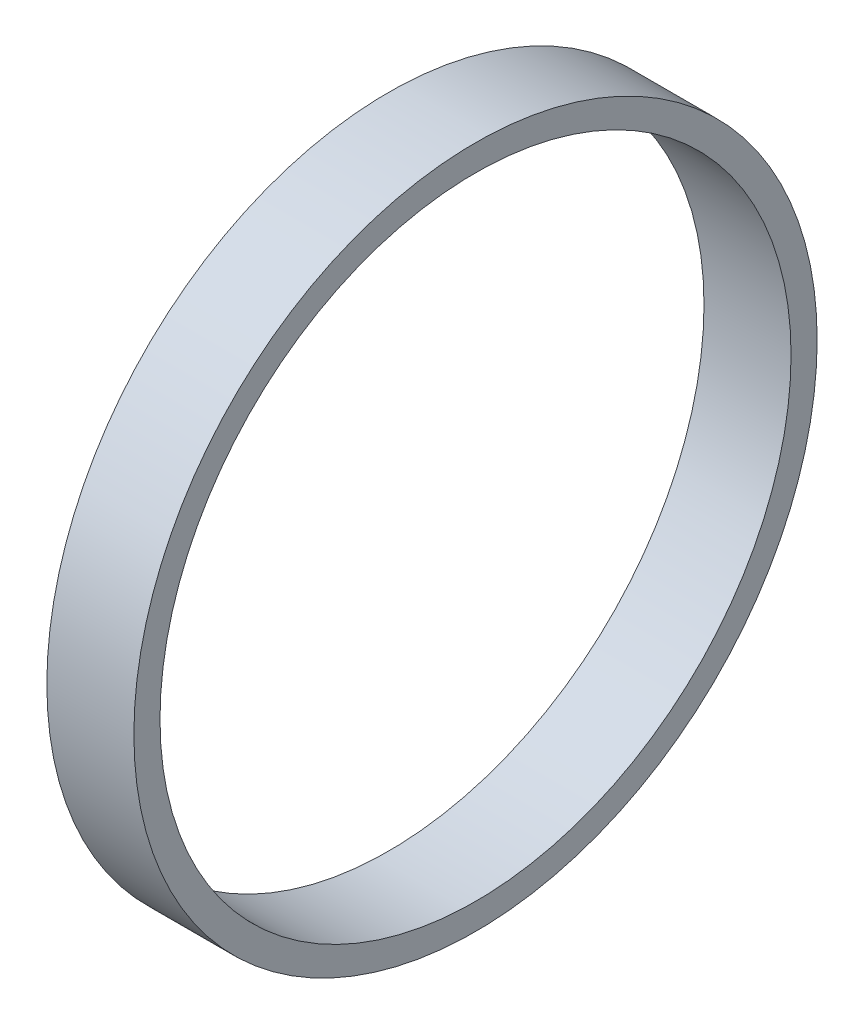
ISO-10303-21;
HEADER;
FILE_DESCRIPTION(('STEP AP214'),'2;1');
FILE_NAME('part.step','',(''),(''),'','','');
FILE_SCHEMA(('AUTOMOTIVE_DESIGN { 1 0 10303 214 1 1 1 1 }'));
ENDSEC;
DATA;
#1=APPLICATION_CONTEXT('core data for automotive mechanical design processes');
#2=APPLICATION_PROTOCOL_DEFINITION('international standard','automotive_design',2000,#1);
#3=PRODUCT_CONTEXT('',#1,'mechanical');
#4=PRODUCT('Part','Part','',(#3));
#5=PRODUCT_RELATED_PRODUCT_CATEGORY('part','',(#4));
#6=PRODUCT_DEFINITION_FORMATION('','',#4);
#7=PRODUCT_DEFINITION_CONTEXT('part definition',#1,'design');
#8=PRODUCT_DEFINITION('design','',#6,#7);
#9=PRODUCT_DEFINITION_SHAPE('','',#8);
#10=(LENGTH_UNIT() NAMED_UNIT(*) SI_UNIT(.MILLI.,.METRE.));
#11=(NAMED_UNIT(*) PLANE_ANGLE_UNIT() SI_UNIT($,.RADIAN.));
#12=(NAMED_UNIT(*) SI_UNIT($,.STERADIAN.) SOLID_ANGLE_UNIT());
#13=UNCERTAINTY_MEASURE_WITH_UNIT(LENGTH_MEASURE(1.E-05),#10,'distance_accuracy_value','');
#14=(GEOMETRIC_REPRESENTATION_CONTEXT(3) GLOBAL_UNCERTAINTY_ASSIGNED_CONTEXT((#13)) GLOBAL_UNIT_ASSIGNED_CONTEXT((#10,
#11,#12)) REPRESENTATION_CONTEXT('',''));
#15=CARTESIAN_POINT('',(0.,0.,0.));
#16=DIRECTION('',(0.,0.,1.));
#17=DIRECTION('',(1.,0.,0.));
#18=AXIS2_PLACEMENT_3D('',#15,#16,#17);
#19=CARTESIAN_POINT('',(0.,29.,0.));
#20=DIRECTION('',(1.,0.,0.));
#21=DIRECTION('',(0.,0.,-1.));
#22=AXIS2_PLACEMENT_3D('',#19,#20,#21);
#23=PLANE('',#22);
#24=CARTESIAN_POINT('',(0.,0.,0.));
#25=DIRECTION('',(-1.,0.,0.));
#26=DIRECTION('',(0.,0.,1.));
#27=AXIS2_PLACEMENT_3D('',#24,#25,#26);
#28=CIRCLE('',#27,29.);
#29=CARTESIAN_POINT('',(0.,0.,29.));
#30=VERTEX_POINT('',#29);
#31=EDGE_CURVE('E43',#30,#30,#28,.T.);
#32=ORIENTED_EDGE('',*,*,#31,.F.);
#33=EDGE_LOOP('',(#32));
#34=FACE_BOUND('',#33,.T.);
#35=CARTESIAN_POINT('',(0.,0.,0.));
#36=DIRECTION('',(-1.,0.,0.));
#37=DIRECTION('',(0.,0.,1.));
#38=AXIS2_PLACEMENT_3D('',#35,#36,#37);
#39=CIRCLE('',#38,31.4);
#40=CARTESIAN_POINT('',(0.,0.,31.4));
#41=VERTEX_POINT('',#40);
#42=EDGE_CURVE('E10',#41,#41,#39,.T.);
#43=ORIENTED_EDGE('',*,*,#42,.T.);
#44=EDGE_LOOP('',(#43));
#45=FACE_BOUND('',#44,.T.);
#46=ADVANCED_FACE('F29',(#34,#45),#23,.F.);
#47=CARTESIAN_POINT('',(0.,0.,0.));
#48=DIRECTION('',(-1.,0.,0.));
#49=DIRECTION('',(0.,0.,1.));
#50=AXIS2_PLACEMENT_3D('',#47,#48,#49);
#51=CYLINDRICAL_SURFACE('',#50,31.4);
#52=ORIENTED_EDGE('',*,*,#42,.F.);
#53=EDGE_LOOP('',(#52));
#54=FACE_BOUND('',#53,.T.);
#55=CARTESIAN_POINT('',(8.,0.,0.));
#56=DIRECTION('',(-1.,0.,0.));
#57=DIRECTION('',(0.,0.,1.));
#58=AXIS2_PLACEMENT_3D('',#55,#56,#57);
#59=CIRCLE('',#58,31.4);
#60=CARTESIAN_POINT('',(8.,0.,31.4));
#61=VERTEX_POINT('',#60);
#62=EDGE_CURVE('E35',#61,#61,#59,.T.);
#63=ORIENTED_EDGE('',*,*,#62,.T.);
#64=EDGE_LOOP('',(#63));
#65=FACE_BOUND('',#64,.T.);
#66=ADVANCED_FACE('F52',(#54,#65),#51,.T.);
#67=CARTESIAN_POINT('',(8.,29.,0.));
#68=DIRECTION('',(-1.,0.,0.));
#69=DIRECTION('',(0.,0.,1.));
#70=AXIS2_PLACEMENT_3D('',#67,#68,#69);
#71=PLANE('',#70);
#72=ORIENTED_EDGE('',*,*,#62,.F.);
#73=EDGE_LOOP('',(#72));
#74=FACE_BOUND('',#73,.T.);
#75=CARTESIAN_POINT('',(8.,0.,0.));
#76=DIRECTION('',(-1.,0.,0.));
#77=DIRECTION('',(0.,0.,1.));
#78=AXIS2_PLACEMENT_3D('',#75,#76,#77);
#79=CIRCLE('',#78,29.);
#80=CARTESIAN_POINT('',(8.,0.,29.));
#81=VERTEX_POINT('',#80);
#82=EDGE_CURVE('E39',#81,#81,#79,.T.);
#83=ORIENTED_EDGE('',*,*,#82,.T.);
#84=EDGE_LOOP('',(#83));
#85=FACE_BOUND('',#84,.T.);
#86=ADVANCED_FACE('F56',(#74,#85),#71,.F.);
#87=CARTESIAN_POINT('',(0.,0.,0.));
#88=DIRECTION('',(-1.,0.,0.));
#89=DIRECTION('',(0.,0.,1.));
#90=AXIS2_PLACEMENT_3D('',#87,#88,#89);
#91=CYLINDRICAL_SURFACE('',#90,29.);
#92=ORIENTED_EDGE('',*,*,#82,.F.);
#93=EDGE_LOOP('',(#92));
#94=FACE_BOUND('',#93,.T.);
#95=ORIENTED_EDGE('',*,*,#31,.T.);
#96=EDGE_LOOP('',(#95));
#97=FACE_BOUND('',#96,.T.);
#98=ADVANCED_FACE('F49',(#94,#97),#91,.F.);
#99=CLOSED_SHELL('',(#46,#66,#86,#98));
#100=MANIFOLD_SOLID_BREP('B2',#99);
#101=ADVANCED_BREP_SHAPE_REPRESENTATION('',(#18,#100),#14);
#102=SHAPE_DEFINITION_REPRESENTATION(#9,#101);
ENDSEC;
END-ISO-10303-21;
